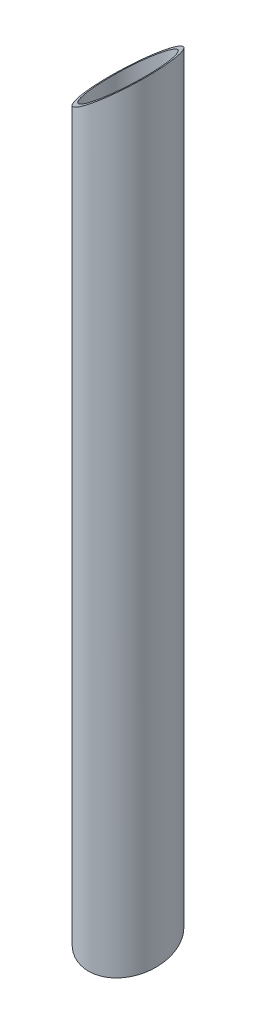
from build123d import *

# Parameters (mm, degrees)
SKIZZE1_R                            = 15
SKIZZE1_R_2                          = 13.5
LINEAR_AUSTRAGEN_D_NN1_DEPTH         = 400
SCHNITT_LINEAR_AUSTRAGEN1_DEPTH      = 401.562105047
SCHNITT_LINEAR_AUSTRAGEN1_DEPTH_BACK = 401.562105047
SCHNITT_LINEAR_AUSTRAGEN2_DEPTH      = 401.562105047
SCHNITT_LINEAR_AUSTRAGEN2_DEPTH_BACK = 401.562105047


with BuildPart() as part:
    # Skizze1 → Linear-Austragen-D_nn1 (new body)
    with BuildSketch(Plane(origin=(0, 0, 0), x_dir=(1, 0, 0), z_dir=(0, 1, 0))):
        Circle(SKIZZE1_R)
        Circle(SKIZZE1_R_2, mode=Mode.SUBTRACT)
    extrude(amount=LINEAR_AUSTRAGEN_D_NN1_DEPTH)

    # Skizze6 → Schnitt-Linear austragen1 (cut, two sides: drawn at the far end of the back side and taken through both)
    with BuildSketch(Plane(origin=(0, 0, 0), x_dir=(0, 0, -1), z_dir=(1, 0, 0)).offset(-SCHNITT_LINEAR_AUSTRAGEN1_DEPTH_BACK)):
        Polygon((799.570204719, 218.263428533), (15, 8.038475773), (-15, 0), (-799.570204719, -210.22495276), (-379.120299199, -1779.365362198), (1220.020110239, -1350.876980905), align=None)
    extrude(amount=SCHNITT_LINEAR_AUSTRAGEN1_DEPTH + SCHNITT_LINEAR_AUSTRAGEN1_DEPTH_BACK, mode=Mode.SUBTRACT)

    # Skizze10 → Schnitt-Linear austragen2 (cut, two sides: drawn at the far end of the back side and taken through both)
    with BuildSketch(Plane(origin=(0, 0, 0), x_dir=(0.9908135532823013, 0, -0.1352349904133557), z_dir=(0.1352349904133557, 0, 0.9908135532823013)).offset(-SCHNITT_LINEAR_AUSTRAGEN2_DEPTH_BACK)):
        Polygon((43.671188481, 321.188537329), (-39.90940488, 254.923119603), (-39.90940488, 417.900351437), (43.671188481, 417.900351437), align=None)
    extrude(amount=SCHNITT_LINEAR_AUSTRAGEN2_DEPTH + SCHNITT_LINEAR_AUSTRAGEN2_DEPTH_BACK, mode=Mode.SUBTRACT)


solid = part.part
